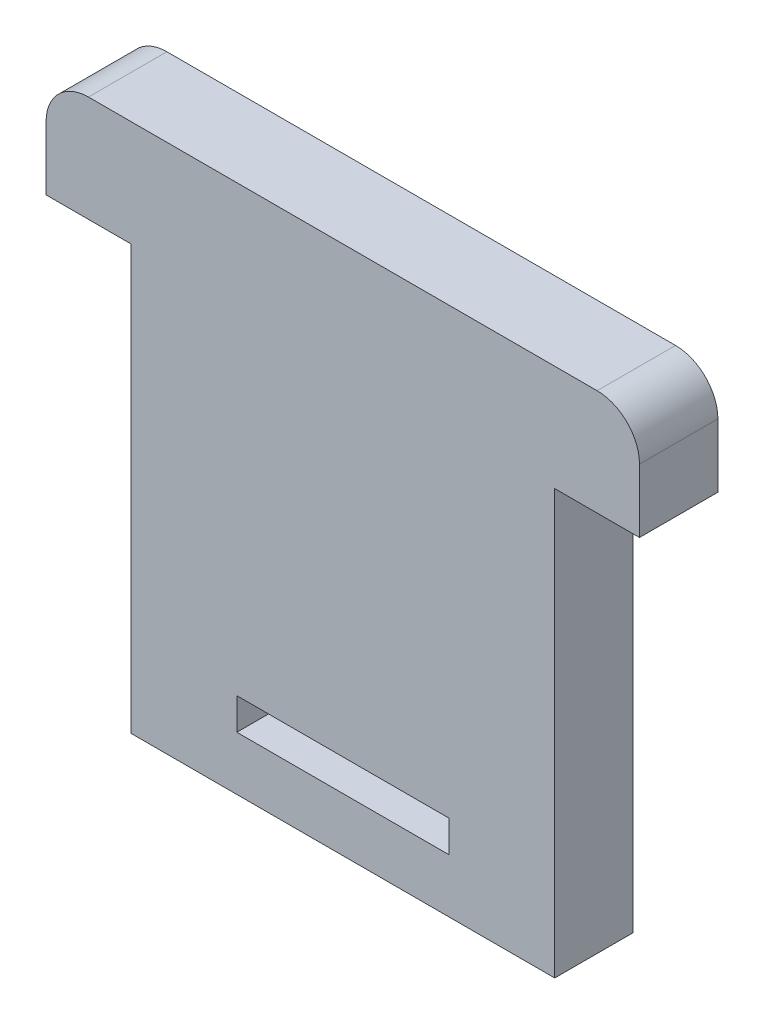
ISO-10303-21;
HEADER;
FILE_DESCRIPTION(('STEP AP214'),'2;1');
FILE_NAME('part.step','',(''),(''),'','','');
FILE_SCHEMA(('AUTOMOTIVE_DESIGN { 1 0 10303 214 1 1 1 1 }'));
ENDSEC;
DATA;
#1=APPLICATION_CONTEXT('core data for automotive mechanical design processes');
#2=APPLICATION_PROTOCOL_DEFINITION('international standard','automotive_design',2000,#1);
#3=PRODUCT_CONTEXT('',#1,'mechanical');
#4=PRODUCT('Part','Part','',(#3));
#5=PRODUCT_RELATED_PRODUCT_CATEGORY('part','',(#4));
#6=PRODUCT_DEFINITION_FORMATION('','',#4);
#7=PRODUCT_DEFINITION_CONTEXT('part definition',#1,'design');
#8=PRODUCT_DEFINITION('design','',#6,#7);
#9=PRODUCT_DEFINITION_SHAPE('','',#8);
#10=(LENGTH_UNIT() NAMED_UNIT(*) SI_UNIT(.MILLI.,.METRE.));
#11=(NAMED_UNIT(*) PLANE_ANGLE_UNIT() SI_UNIT($,.RADIAN.));
#12=(NAMED_UNIT(*) SI_UNIT($,.STERADIAN.) SOLID_ANGLE_UNIT());
#13=UNCERTAINTY_MEASURE_WITH_UNIT(LENGTH_MEASURE(1.E-05),#10,'distance_accuracy_value','');
#14=(GEOMETRIC_REPRESENTATION_CONTEXT(3) GLOBAL_UNCERTAINTY_ASSIGNED_CONTEXT((#13)) GLOBAL_UNIT_ASSIGNED_CONTEXT((#10,
#11,#12)) REPRESENTATION_CONTEXT('',''));
#15=CARTESIAN_POINT('',(0.,0.,0.));
#16=DIRECTION('',(0.,0.,1.));
#17=DIRECTION('',(1.,0.,0.));
#18=AXIS2_PLACEMENT_3D('',#15,#16,#17);
#19=CARTESIAN_POINT('',(-17.78,19.05,2.3495));
#20=DIRECTION('',(1.,0.,0.));
#21=DIRECTION('',(0.,0.,-1.));
#22=AXIS2_PLACEMENT_3D('',#19,#20,#21);
#23=PLANE('',#22);
#24=DIRECTION('',(0.,-1.,0.));
#25=VECTOR('',#24,1.);
#26=CARTESIAN_POINT('',(-17.78,19.05,2.3495));
#27=LINE('',#26,#25);
#28=CARTESIAN_POINT('',(-17.78,16.51,2.3495));
#29=VERTEX_POINT('',#28);
#30=CARTESIAN_POINT('',(-17.78,12.7,2.3495));
#31=VERTEX_POINT('',#30);
#32=EDGE_CURVE('E182',#29,#31,#27,.T.);
#33=ORIENTED_EDGE('',*,*,#32,.F.);
#34=DIRECTION('',(0.,0.,-1.));
#35=VECTOR('',#34,1.);
#36=CARTESIAN_POINT('',(-17.78,16.51,2.3495));
#37=LINE('',#36,#35);
#38=CARTESIAN_POINT('',(-17.78,16.51,-2.3495));
#39=VERTEX_POINT('',#38);
#40=EDGE_CURVE('E11',#29,#39,#37,.T.);
#41=ORIENTED_EDGE('',*,*,#40,.T.);
#42=DIRECTION('',(0.,-1.,0.));
#43=VECTOR('',#42,1.);
#44=CARTESIAN_POINT('',(-17.78,19.05,-2.3495));
#45=LINE('',#44,#43);
#46=CARTESIAN_POINT('',(-17.78,12.7,-2.3495));
#47=VERTEX_POINT('',#46);
#48=EDGE_CURVE('E178',#39,#47,#45,.T.);
#49=ORIENTED_EDGE('',*,*,#48,.T.);
#50=DIRECTION('',(0.,0.,-1.));
#51=VECTOR('',#50,1.);
#52=CARTESIAN_POINT('',(-17.78,12.7,2.3495));
#53=LINE('',#52,#51);
#54=EDGE_CURVE('E229',#31,#47,#53,.T.);
#55=ORIENTED_EDGE('',*,*,#54,.F.);
#56=EDGE_LOOP('',(#33,#41,#49,#55));
#57=FACE_BOUND('',#56,.T.);
#58=ADVANCED_FACE('F35',(#57),#23,.F.);
#59=CARTESIAN_POINT('',(-17.78,12.7,2.3495));
#60=DIRECTION('',(0.,1.,0.));
#61=DIRECTION('',(0.,0.,1.));
#62=AXIS2_PLACEMENT_3D('',#59,#60,#61);
#63=PLANE('',#62);
#64=DIRECTION('',(1.,0.,0.));
#65=VECTOR('',#64,1.);
#66=CARTESIAN_POINT('',(-17.78,12.7,-2.3495));
#67=LINE('',#66,#65);
#68=CARTESIAN_POINT('',(-12.7,12.7,-2.3495));
#69=VERTEX_POINT('',#68);
#70=EDGE_CURVE('E201',#47,#69,#67,.T.);
#71=ORIENTED_EDGE('',*,*,#70,.T.);
#72=DIRECTION('',(0.,0.,-1.));
#73=VECTOR('',#72,1.);
#74=CARTESIAN_POINT('',(-12.7,12.7,2.3495));
#75=LINE('',#74,#73);
#76=CARTESIAN_POINT('',(-12.7,12.7,2.3495));
#77=VERTEX_POINT('',#76);
#78=EDGE_CURVE('E226',#77,#69,#75,.T.);
#79=ORIENTED_EDGE('',*,*,#78,.F.);
#80=DIRECTION('',(1.,0.,0.));
#81=VECTOR('',#80,1.);
#82=CARTESIAN_POINT('',(-17.78,12.7,2.3495));
#83=LINE('',#82,#81);
#84=EDGE_CURVE('E184',#31,#77,#83,.T.);
#85=ORIENTED_EDGE('',*,*,#84,.F.);
#86=ORIENTED_EDGE('',*,*,#54,.T.);
#87=EDGE_LOOP('',(#71,#79,#85,#86));
#88=FACE_BOUND('',#87,.T.);
#89=ADVANCED_FACE('F281',(#88),#63,.F.);
#90=CARTESIAN_POINT('',(-12.7,12.7,2.3495));
#91=DIRECTION('',(1.,0.,0.));
#92=DIRECTION('',(0.,0.,-1.));
#93=AXIS2_PLACEMENT_3D('',#90,#91,#92);
#94=PLANE('',#93);
#95=DIRECTION('',(0.,-1.,0.));
#96=VECTOR('',#95,1.);
#97=CARTESIAN_POINT('',(-12.7,12.7,-2.3495));
#98=LINE('',#97,#96);
#99=CARTESIAN_POINT('',(-12.7,-12.7,-2.3495));
#100=VERTEX_POINT('',#99);
#101=EDGE_CURVE('E203',#69,#100,#98,.T.);
#102=ORIENTED_EDGE('',*,*,#101,.T.);
#103=DIRECTION('',(0.,0.,-1.));
#104=VECTOR('',#103,1.);
#105=CARTESIAN_POINT('',(-12.7,-12.7,2.3495));
#106=LINE('',#105,#104);
#107=CARTESIAN_POINT('',(-12.7,-12.7,2.3495));
#108=VERTEX_POINT('',#107);
#109=EDGE_CURVE('E223',#108,#100,#106,.T.);
#110=ORIENTED_EDGE('',*,*,#109,.F.);
#111=DIRECTION('',(0.,-1.,0.));
#112=VECTOR('',#111,1.);
#113=CARTESIAN_POINT('',(-12.7,12.7,2.3495));
#114=LINE('',#113,#112);
#115=EDGE_CURVE('E187',#77,#108,#114,.T.);
#116=ORIENTED_EDGE('',*,*,#115,.F.);
#117=ORIENTED_EDGE('',*,*,#78,.T.);
#118=EDGE_LOOP('',(#102,#110,#116,#117));
#119=FACE_BOUND('',#118,.T.);
#120=ADVANCED_FACE('F274',(#119),#94,.F.);
#121=CARTESIAN_POINT('',(-12.7,-12.7,2.3495));
#122=DIRECTION('',(0.,1.,0.));
#123=DIRECTION('',(0.,0.,1.));
#124=AXIS2_PLACEMENT_3D('',#121,#122,#123);
#125=PLANE('',#124);
#126=DIRECTION('',(1.,0.,0.));
#127=VECTOR('',#126,1.);
#128=CARTESIAN_POINT('',(-12.7,-12.7,-2.3495));
#129=LINE('',#128,#127);
#130=CARTESIAN_POINT('',(12.7,-12.7,-2.3495));
#131=VERTEX_POINT('',#130);
#132=EDGE_CURVE('E205',#100,#131,#129,.T.);
#133=ORIENTED_EDGE('',*,*,#132,.T.);
#134=DIRECTION('',(0.,0.,-1.));
#135=VECTOR('',#134,1.);
#136=CARTESIAN_POINT('',(12.7,-12.7,2.3495));
#137=LINE('',#136,#135);
#138=CARTESIAN_POINT('',(12.7,-12.7,2.3495));
#139=VERTEX_POINT('',#138);
#140=EDGE_CURVE('E220',#139,#131,#137,.T.);
#141=ORIENTED_EDGE('',*,*,#140,.F.);
#142=DIRECTION('',(1.,0.,0.));
#143=VECTOR('',#142,1.);
#144=CARTESIAN_POINT('',(-12.7,-12.7,2.3495));
#145=LINE('',#144,#143);
#146=EDGE_CURVE('E189',#108,#139,#145,.T.);
#147=ORIENTED_EDGE('',*,*,#146,.F.);
#148=ORIENTED_EDGE('',*,*,#109,.T.);
#149=EDGE_LOOP('',(#133,#141,#147,#148));
#150=FACE_BOUND('',#149,.T.);
#151=ADVANCED_FACE('F270',(#150),#125,.F.);
#152=CARTESIAN_POINT('',(12.7,-12.7,2.3495));
#153=DIRECTION('',(-1.,0.,0.));
#154=DIRECTION('',(0.,0.,1.));
#155=AXIS2_PLACEMENT_3D('',#152,#153,#154);
#156=PLANE('',#155);
#157=DIRECTION('',(0.,1.,0.));
#158=VECTOR('',#157,1.);
#159=CARTESIAN_POINT('',(12.7,-12.7,-2.3495));
#160=LINE('',#159,#158);
#161=CARTESIAN_POINT('',(12.7,12.7,-2.3495));
#162=VERTEX_POINT('',#161);
#163=EDGE_CURVE('E207',#131,#162,#160,.T.);
#164=ORIENTED_EDGE('',*,*,#163,.T.);
#165=DIRECTION('',(0.,0.,-1.));
#166=VECTOR('',#165,1.);
#167=CARTESIAN_POINT('',(12.7,12.7,2.3495));
#168=LINE('',#167,#166);
#169=CARTESIAN_POINT('',(12.7,12.7,2.3495));
#170=VERTEX_POINT('',#169);
#171=EDGE_CURVE('E217',#170,#162,#168,.T.);
#172=ORIENTED_EDGE('',*,*,#171,.F.);
#173=DIRECTION('',(0.,1.,0.));
#174=VECTOR('',#173,1.);
#175=CARTESIAN_POINT('',(12.7,-12.7,2.3495));
#176=LINE('',#175,#174);
#177=EDGE_CURVE('E191',#139,#170,#176,.T.);
#178=ORIENTED_EDGE('',*,*,#177,.F.);
#179=ORIENTED_EDGE('',*,*,#140,.T.);
#180=EDGE_LOOP('',(#164,#172,#178,#179));
#181=FACE_BOUND('',#180,.T.);
#182=ADVANCED_FACE('F265',(#181),#156,.F.);
#183=CARTESIAN_POINT('',(12.7,12.7,2.3495));
#184=DIRECTION('',(0.,1.,0.));
#185=DIRECTION('',(0.,0.,1.));
#186=AXIS2_PLACEMENT_3D('',#183,#184,#185);
#187=PLANE('',#186);
#188=DIRECTION('',(1.,0.,0.));
#189=VECTOR('',#188,1.);
#190=CARTESIAN_POINT('',(12.7,12.7,-2.3495));
#191=LINE('',#190,#189);
#192=CARTESIAN_POINT('',(17.78,12.7,-2.3495));
#193=VERTEX_POINT('',#192);
#194=EDGE_CURVE('E209',#162,#193,#191,.T.);
#195=ORIENTED_EDGE('',*,*,#194,.T.);
#196=DIRECTION('',(0.,0.,-1.));
#197=VECTOR('',#196,1.);
#198=CARTESIAN_POINT('',(17.78,12.7,2.3495));
#199=LINE('',#198,#197);
#200=CARTESIAN_POINT('',(17.78,12.7,2.3495));
#201=VERTEX_POINT('',#200);
#202=EDGE_CURVE('E199',#201,#193,#199,.T.);
#203=ORIENTED_EDGE('',*,*,#202,.F.);
#204=DIRECTION('',(1.,0.,0.));
#205=VECTOR('',#204,1.);
#206=CARTESIAN_POINT('',(12.7,12.7,2.3495));
#207=LINE('',#206,#205);
#208=EDGE_CURVE('E193',#170,#201,#207,.T.);
#209=ORIENTED_EDGE('',*,*,#208,.F.);
#210=ORIENTED_EDGE('',*,*,#171,.T.);
#211=EDGE_LOOP('',(#195,#203,#209,#210));
#212=FACE_BOUND('',#211,.T.);
#213=ADVANCED_FACE('F259',(#212),#187,.F.);
#214=CARTESIAN_POINT('',(17.78,12.7,2.3495));
#215=DIRECTION('',(-1.,0.,0.));
#216=DIRECTION('',(0.,0.,1.));
#217=AXIS2_PLACEMENT_3D('',#214,#215,#216);
#218=PLANE('',#217);
#219=DIRECTION('',(0.,1.,0.));
#220=VECTOR('',#219,1.);
#221=CARTESIAN_POINT('',(17.78,12.7,-2.3495));
#222=LINE('',#221,#220);
#223=CARTESIAN_POINT('',(17.78,16.51,-2.3495));
#224=VERTEX_POINT('',#223);
#225=EDGE_CURVE('E211',#193,#224,#222,.T.);
#226=ORIENTED_EDGE('',*,*,#225,.T.);
#227=DIRECTION('',(0.,0.,-1.));
#228=VECTOR('',#227,1.);
#229=CARTESIAN_POINT('',(17.78,16.51,2.3495));
#230=LINE('',#229,#228);
#231=CARTESIAN_POINT('',(17.78,16.51,2.3495));
#232=VERTEX_POINT('',#231);
#233=EDGE_CURVE('E58',#224,#232,#230,.F.);
#234=ORIENTED_EDGE('',*,*,#233,.T.);
#235=DIRECTION('',(0.,1.,0.));
#236=VECTOR('',#235,1.);
#237=CARTESIAN_POINT('',(17.78,12.7,2.3495));
#238=LINE('',#237,#236);
#239=EDGE_CURVE('E195',#201,#232,#238,.T.);
#240=ORIENTED_EDGE('',*,*,#239,.F.);
#241=ORIENTED_EDGE('',*,*,#202,.T.);
#242=EDGE_LOOP('',(#226,#234,#240,#241));
#243=FACE_BOUND('',#242,.T.);
#244=ADVANCED_FACE('F255',(#243),#218,.F.);
#245=CARTESIAN_POINT('',(17.78,19.05,2.3495));
#246=DIRECTION('',(0.,-1.,0.));
#247=DIRECTION('',(0.,0.,-1.));
#248=AXIS2_PLACEMENT_3D('',#245,#246,#247);
#249=PLANE('',#248);
#250=DIRECTION('',(-1.,0.,0.));
#251=VECTOR('',#250,1.);
#252=CARTESIAN_POINT('',(17.78,19.05,2.3495));
#253=LINE('',#252,#251);
#254=CARTESIAN_POINT('',(15.24,19.05,2.3495));
#255=VERTEX_POINT('',#254);
#256=CARTESIAN_POINT('',(-15.24,19.05,2.3495));
#257=VERTEX_POINT('',#256);
#258=EDGE_CURVE('E197',#255,#257,#253,.T.);
#259=ORIENTED_EDGE('',*,*,#258,.F.);
#260=DIRECTION('',(0.,0.,-1.));
#261=VECTOR('',#260,1.);
#262=CARTESIAN_POINT('',(15.24,19.05,2.3495));
#263=LINE('',#262,#261);
#264=CARTESIAN_POINT('',(15.24,19.05,-2.3495));
#265=VERTEX_POINT('',#264);
#266=EDGE_CURVE('E234',#255,#265,#263,.T.);
#267=ORIENTED_EDGE('',*,*,#266,.T.);
#268=DIRECTION('',(-1.,0.,0.));
#269=VECTOR('',#268,1.);
#270=CARTESIAN_POINT('',(17.78,19.05,-2.3495));
#271=LINE('',#270,#269);
#272=CARTESIAN_POINT('',(-15.24,19.05,-2.3495));
#273=VERTEX_POINT('',#272);
#274=EDGE_CURVE('E185',#265,#273,#271,.T.);
#275=ORIENTED_EDGE('',*,*,#274,.T.);
#276=DIRECTION('',(0.,0.,-1.));
#277=VECTOR('',#276,1.);
#278=CARTESIAN_POINT('',(-15.24,19.05,2.3495));
#279=LINE('',#278,#277);
#280=EDGE_CURVE('E232',#273,#257,#279,.F.);
#281=ORIENTED_EDGE('',*,*,#280,.T.);
#282=EDGE_LOOP('',(#259,#267,#275,#281));
#283=FACE_BOUND('',#282,.T.);
#284=ADVANCED_FACE('F247',(#283),#249,.F.);
#285=CARTESIAN_POINT('',(0.,0.,2.3495));
#286=DIRECTION('',(0.,0.,1.));
#287=DIRECTION('',(1.,0.,0.));
#288=AXIS2_PLACEMENT_3D('',#285,#286,#287);
#289=PLANE('',#288);
#290=DIRECTION('',(0.,1.,0.));
#291=VECTOR('',#290,1.);
#292=CARTESIAN_POINT('',(-6.35,-9.47161658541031,2.3495));
#293=LINE('',#292,#291);
#294=CARTESIAN_POINT('',(-6.35,-9.47161658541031,2.3495));
#295=VERTEX_POINT('',#294);
#296=CARTESIAN_POINT('',(-6.35,-7.57161658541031,2.3495));
#297=VERTEX_POINT('',#296);
#298=EDGE_CURVE('E143',#295,#297,#293,.T.);
#299=ORIENTED_EDGE('',*,*,#298,.T.);
#300=DIRECTION('',(1.,0.,0.));
#301=VECTOR('',#300,1.);
#302=CARTESIAN_POINT('',(-6.35,-7.57161658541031,2.3495));
#303=LINE('',#302,#301);
#304=CARTESIAN_POINT('',(6.34999999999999,-7.57161658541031,2.3495));
#305=VERTEX_POINT('',#304);
#306=EDGE_CURVE('E155',#297,#305,#303,.T.);
#307=ORIENTED_EDGE('',*,*,#306,.T.);
#308=DIRECTION('',(0.,-1.,0.));
#309=VECTOR('',#308,1.);
#310=CARTESIAN_POINT('',(6.34999999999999,-7.57161658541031,2.3495));
#311=LINE('',#310,#309);
#312=CARTESIAN_POINT('',(6.34999999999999,-9.47161658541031,2.3495));
#313=VERTEX_POINT('',#312);
#314=EDGE_CURVE('E159',#305,#313,#311,.T.);
#315=ORIENTED_EDGE('',*,*,#314,.T.);
#316=DIRECTION('',(-1.,0.,0.));
#317=VECTOR('',#316,1.);
#318=CARTESIAN_POINT('',(6.34999999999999,-9.47161658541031,2.3495));
#319=LINE('',#318,#317);
#320=EDGE_CURVE('E151',#313,#295,#319,.T.);
#321=ORIENTED_EDGE('',*,*,#320,.T.);
#322=EDGE_LOOP('',(#299,#307,#315,#321));
#323=FACE_BOUND('',#322,.T.);
#324=ORIENTED_EDGE('',*,*,#239,.T.);
#325=CARTESIAN_POINT('',(15.24,16.51,2.3495));
#326=DIRECTION('',(0.,0.,1.));
#327=DIRECTION('',(1.,0.,0.));
#328=AXIS2_PLACEMENT_3D('',#325,#326,#327);
#329=CIRCLE('',#328,2.54);
#330=EDGE_CURVE('E43',#232,#255,#329,.T.);
#331=ORIENTED_EDGE('',*,*,#330,.T.);
#332=ORIENTED_EDGE('',*,*,#258,.T.);
#333=CARTESIAN_POINT('',(-15.24,16.51,2.3495));
#334=DIRECTION('',(0.,0.,1.));
#335=DIRECTION('',(1.,0.,0.));
#336=AXIS2_PLACEMENT_3D('',#333,#334,#335);
#337=CIRCLE('',#336,2.54);
#338=EDGE_CURVE('E50',#257,#29,#337,.T.);
#339=ORIENTED_EDGE('',*,*,#338,.T.);
#340=ORIENTED_EDGE('',*,*,#32,.T.);
#341=ORIENTED_EDGE('',*,*,#84,.T.);
#342=ORIENTED_EDGE('',*,*,#115,.T.);
#343=ORIENTED_EDGE('',*,*,#146,.T.);
#344=ORIENTED_EDGE('',*,*,#177,.T.);
#345=ORIENTED_EDGE('',*,*,#208,.T.);
#346=EDGE_LOOP('',(#324,#331,#332,#339,#340,#341,#342,#343,#344,#345));
#347=FACE_BOUND('',#346,.T.);
#348=ADVANCED_FACE('F161',(#323,#347),#289,.T.);
#349=CARTESIAN_POINT('',(0.,0.,-2.3495));
#350=DIRECTION('',(0.,0.,1.));
#351=DIRECTION('',(1.,0.,0.));
#352=AXIS2_PLACEMENT_3D('',#349,#350,#351);
#353=PLANE('',#352);
#354=DIRECTION('',(1.,0.,0.));
#355=VECTOR('',#354,1.);
#356=CARTESIAN_POINT('',(-6.35,-7.57161658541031,-2.3495));
#357=LINE('',#356,#355);
#358=CARTESIAN_POINT('',(-6.35,-7.57161658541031,-2.3495));
#359=VERTEX_POINT('',#358);
#360=CARTESIAN_POINT('',(6.34999999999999,-7.57161658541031,-2.3495));
#361=VERTEX_POINT('',#360);
#362=EDGE_CURVE('E172',#359,#361,#357,.T.);
#363=ORIENTED_EDGE('',*,*,#362,.F.);
#364=DIRECTION('',(0.,1.,0.));
#365=VECTOR('',#364,1.);
#366=CARTESIAN_POINT('',(-6.35,-9.47161658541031,-2.3495));
#367=LINE('',#366,#365);
#368=CARTESIAN_POINT('',(-6.35,-9.47161658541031,-2.3495));
#369=VERTEX_POINT('',#368);
#370=EDGE_CURVE('E146',#369,#359,#367,.T.);
#371=ORIENTED_EDGE('',*,*,#370,.F.);
#372=DIRECTION('',(-1.,0.,0.));
#373=VECTOR('',#372,1.);
#374=CARTESIAN_POINT('',(6.34999999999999,-9.47161658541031,-2.3495));
#375=LINE('',#374,#373);
#376=CARTESIAN_POINT('',(6.34999999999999,-9.47161658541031,-2.3495));
#377=VERTEX_POINT('',#376);
#378=EDGE_CURVE('E163',#377,#369,#375,.T.);
#379=ORIENTED_EDGE('',*,*,#378,.F.);
#380=DIRECTION('',(0.,-1.,0.));
#381=VECTOR('',#380,1.);
#382=CARTESIAN_POINT('',(6.34999999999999,-7.57161658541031,-2.3495));
#383=LINE('',#382,#381);
#384=EDGE_CURVE('E166',#361,#377,#383,.T.);
#385=ORIENTED_EDGE('',*,*,#384,.F.);
#386=EDGE_LOOP('',(#363,#371,#379,#385));
#387=FACE_BOUND('',#386,.T.);
#388=ORIENTED_EDGE('',*,*,#274,.F.);
#389=CARTESIAN_POINT('',(15.24,16.51,-2.3495));
#390=DIRECTION('',(0.,0.,1.));
#391=DIRECTION('',(1.,0.,0.));
#392=AXIS2_PLACEMENT_3D('',#389,#390,#391);
#393=CIRCLE('',#392,2.54);
#394=EDGE_CURVE('E239',#265,#224,#393,.F.);
#395=ORIENTED_EDGE('',*,*,#394,.T.);
#396=ORIENTED_EDGE('',*,*,#225,.F.);
#397=ORIENTED_EDGE('',*,*,#194,.F.);
#398=ORIENTED_EDGE('',*,*,#163,.F.);
#399=ORIENTED_EDGE('',*,*,#132,.F.);
#400=ORIENTED_EDGE('',*,*,#101,.F.);
#401=ORIENTED_EDGE('',*,*,#70,.F.);
#402=ORIENTED_EDGE('',*,*,#48,.F.);
#403=CARTESIAN_POINT('',(-15.24,16.51,-2.3495));
#404=DIRECTION('',(0.,0.,1.));
#405=DIRECTION('',(1.,0.,0.));
#406=AXIS2_PLACEMENT_3D('',#403,#404,#405);
#407=CIRCLE('',#406,2.54);
#408=EDGE_CURVE('E237',#39,#273,#407,.F.);
#409=ORIENTED_EDGE('',*,*,#408,.T.);
#410=EDGE_LOOP('',(#388,#395,#396,#397,#398,#399,#400,#401,#402,#409));
#411=FACE_BOUND('',#410,.T.);
#412=ADVANCED_FACE('F253',(#387,#411),#353,.F.);
#413=CARTESIAN_POINT('',(-6.35,-9.47161658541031,2.3495));
#414=DIRECTION('',(-1.,0.,0.));
#415=DIRECTION('',(0.,0.,1.));
#416=AXIS2_PLACEMENT_3D('',#413,#414,#415);
#417=PLANE('',#416);
#418=ORIENTED_EDGE('',*,*,#370,.T.);
#419=DIRECTION('',(0.,0.,-1.));
#420=VECTOR('',#419,1.);
#421=CARTESIAN_POINT('',(-6.35,-7.57161658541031,2.3495));
#422=LINE('',#421,#420);
#423=EDGE_CURVE('E139',#297,#359,#422,.T.);
#424=ORIENTED_EDGE('',*,*,#423,.F.);
#425=ORIENTED_EDGE('',*,*,#298,.F.);
#426=DIRECTION('',(0.,0.,-1.));
#427=VECTOR('',#426,1.);
#428=CARTESIAN_POINT('',(-6.35,-9.47161658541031,2.3495));
#429=LINE('',#428,#427);
#430=EDGE_CURVE('E176',#295,#369,#429,.T.);
#431=ORIENTED_EDGE('',*,*,#430,.T.);
#432=EDGE_LOOP('',(#418,#424,#425,#431));
#433=FACE_BOUND('',#432,.T.);
#434=ADVANCED_FACE('F141',(#433),#417,.F.);
#435=CARTESIAN_POINT('',(6.34999999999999,-9.47161658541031,2.3495));
#436=DIRECTION('',(0.,-1.,0.));
#437=DIRECTION('',(0.,0.,-1.));
#438=AXIS2_PLACEMENT_3D('',#435,#436,#437);
#439=PLANE('',#438);
#440=ORIENTED_EDGE('',*,*,#378,.T.);
#441=ORIENTED_EDGE('',*,*,#430,.F.);
#442=ORIENTED_EDGE('',*,*,#320,.F.);
#443=DIRECTION('',(0.,0.,-1.));
#444=VECTOR('',#443,1.);
#445=CARTESIAN_POINT('',(6.34999999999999,-9.47161658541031,2.3495));
#446=LINE('',#445,#444);
#447=EDGE_CURVE('E179',#313,#377,#446,.T.);
#448=ORIENTED_EDGE('',*,*,#447,.T.);
#449=EDGE_LOOP('',(#440,#441,#442,#448));
#450=FACE_BOUND('',#449,.T.);
#451=ADVANCED_FACE('F315',(#450),#439,.F.);
#452=CARTESIAN_POINT('',(6.34999999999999,-7.57161658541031,2.3495));
#453=DIRECTION('',(1.,0.,0.));
#454=DIRECTION('',(0.,0.,-1.));
#455=AXIS2_PLACEMENT_3D('',#452,#453,#454);
#456=PLANE('',#455);
#457=ORIENTED_EDGE('',*,*,#384,.T.);
#458=ORIENTED_EDGE('',*,*,#447,.F.);
#459=ORIENTED_EDGE('',*,*,#314,.F.);
#460=DIRECTION('',(0.,0.,-1.));
#461=VECTOR('',#460,1.);
#462=CARTESIAN_POINT('',(6.34999999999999,-7.57161658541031,2.3495));
#463=LINE('',#462,#461);
#464=EDGE_CURVE('E150',#305,#361,#463,.T.);
#465=ORIENTED_EDGE('',*,*,#464,.T.);
#466=EDGE_LOOP('',(#457,#458,#459,#465));
#467=FACE_BOUND('',#466,.T.);
#468=ADVANCED_FACE('F318',(#467),#456,.F.);
#469=CARTESIAN_POINT('',(-6.35,-7.57161658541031,2.3495));
#470=DIRECTION('',(0.,1.,0.));
#471=DIRECTION('',(0.,0.,1.));
#472=AXIS2_PLACEMENT_3D('',#469,#470,#471);
#473=PLANE('',#472);
#474=ORIENTED_EDGE('',*,*,#362,.T.);
#475=ORIENTED_EDGE('',*,*,#464,.F.);
#476=ORIENTED_EDGE('',*,*,#306,.F.);
#477=ORIENTED_EDGE('',*,*,#423,.T.);
#478=EDGE_LOOP('',(#474,#475,#476,#477));
#479=FACE_BOUND('',#478,.T.);
#480=ADVANCED_FACE('F156',(#479),#473,.F.);
#481=CARTESIAN_POINT('',(15.24,16.51,2.3495));
#482=DIRECTION('',(0.,0.,-1.));
#483=DIRECTION('',(-1.,0.,0.));
#484=AXIS2_PLACEMENT_3D('',#481,#482,#483);
#485=CYLINDRICAL_SURFACE('',#484,2.54);
#486=ORIENTED_EDGE('',*,*,#330,.F.);
#487=ORIENTED_EDGE('',*,*,#233,.F.);
#488=ORIENTED_EDGE('',*,*,#394,.F.);
#489=ORIENTED_EDGE('',*,*,#266,.F.);
#490=EDGE_LOOP('',(#486,#487,#488,#489));
#491=FACE_BOUND('',#490,.T.);
#492=ADVANCED_FACE('F250',(#491),#485,.T.);
#493=CARTESIAN_POINT('',(-15.24,16.51,2.3495));
#494=DIRECTION('',(0.,0.,-1.));
#495=DIRECTION('',(-1.,0.,0.));
#496=AXIS2_PLACEMENT_3D('',#493,#494,#495);
#497=CYLINDRICAL_SURFACE('',#496,2.54);
#498=ORIENTED_EDGE('',*,*,#338,.F.);
#499=ORIENTED_EDGE('',*,*,#280,.F.);
#500=ORIENTED_EDGE('',*,*,#408,.F.);
#501=ORIENTED_EDGE('',*,*,#40,.F.);
#502=EDGE_LOOP('',(#498,#499,#500,#501));
#503=FACE_BOUND('',#502,.T.);
#504=ADVANCED_FACE('F37',(#503),#497,.T.);
#505=CLOSED_SHELL('',(#58,#89,#120,#151,#182,#213,#244,#284,#348,#412,#434,#451,#468,#480,#492,#504));
#506=MANIFOLD_SOLID_BREP('B2',#505);
#507=ADVANCED_BREP_SHAPE_REPRESENTATION('',(#18,#506),#14);
#508=SHAPE_DEFINITION_REPRESENTATION(#9,#507);
ENDSEC;
END-ISO-10303-21;
